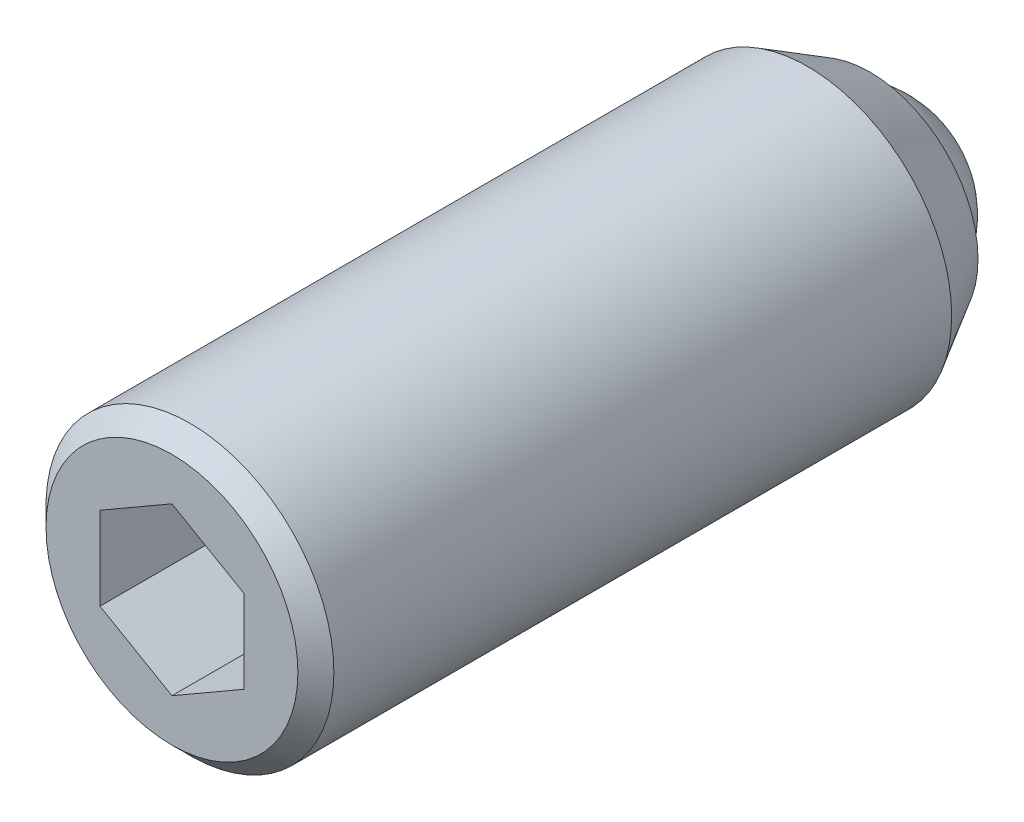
ISO-10303-21;
HEADER;
FILE_DESCRIPTION(('STEP AP214'),'2;1');
FILE_NAME('part.step','',(''),(''),'','','');
FILE_SCHEMA(('AUTOMOTIVE_DESIGN { 1 0 10303 214 1 1 1 1 }'));
ENDSEC;
DATA;
#1=APPLICATION_CONTEXT('core data for automotive mechanical design processes');
#2=APPLICATION_PROTOCOL_DEFINITION('international standard','automotive_design',2000,#1);
#3=PRODUCT_CONTEXT('',#1,'mechanical');
#4=PRODUCT('Part','Part','',(#3));
#5=PRODUCT_RELATED_PRODUCT_CATEGORY('part','',(#4));
#6=PRODUCT_DEFINITION_FORMATION('','',#4);
#7=PRODUCT_DEFINITION_CONTEXT('part definition',#1,'design');
#8=PRODUCT_DEFINITION('design','',#6,#7);
#9=PRODUCT_DEFINITION_SHAPE('','',#8);
#10=(LENGTH_UNIT() NAMED_UNIT(*) SI_UNIT(.MILLI.,.METRE.));
#11=(NAMED_UNIT(*) PLANE_ANGLE_UNIT() SI_UNIT($,.RADIAN.));
#12=(NAMED_UNIT(*) SI_UNIT($,.STERADIAN.) SOLID_ANGLE_UNIT());
#13=UNCERTAINTY_MEASURE_WITH_UNIT(LENGTH_MEASURE(1.E-05),#10,'distance_accuracy_value','');
#14=(GEOMETRIC_REPRESENTATION_CONTEXT(3) GLOBAL_UNCERTAINTY_ASSIGNED_CONTEXT((#13)) GLOBAL_UNIT_ASSIGNED_CONTEXT((#10,
#11,#12)) REPRESENTATION_CONTEXT('',''));
#15=CARTESIAN_POINT('',(0.,0.,0.));
#16=DIRECTION('',(0.,0.,1.));
#17=DIRECTION('',(1.,0.,0.));
#18=AXIS2_PLACEMENT_3D('',#15,#16,#17);
#19=CARTESIAN_POINT('',(2.,1.15470053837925,18.75));
#20=DIRECTION('',(0.5,0.86602540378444,0.));
#21=DIRECTION('',(0.86602540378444,-0.5,0.));
#22=AXIS2_PLACEMENT_3D('',#19,#20,#21);
#23=PLANE('',#22);
#24=DIRECTION('',(0.,0.,1.));
#25=VECTOR('',#24,1.);
#26=CARTESIAN_POINT('',(2.,1.15470053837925,18.75));
#27=LINE('',#26,#25);
#28=CARTESIAN_POINT('',(2.,1.15470053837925,17.25));
#29=VERTEX_POINT('',#28);
#30=CARTESIAN_POINT('',(2.,1.15470053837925,21.25));
#31=VERTEX_POINT('',#30);
#32=EDGE_CURVE('E68',#29,#31,#27,.T.);
#33=ORIENTED_EDGE('',*,*,#32,.T.);
#34=DIRECTION('',(-0.86602540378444,0.5,0.));
#35=VECTOR('',#34,1.);
#36=CARTESIAN_POINT('',(2.,1.15470053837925,21.25));
#37=LINE('',#36,#35);
#38=CARTESIAN_POINT('',(0.,2.3094010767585,21.25));
#39=VERTEX_POINT('',#38);
#40=EDGE_CURVE('E29',#31,#39,#37,.T.);
#41=ORIENTED_EDGE('',*,*,#40,.T.);
#42=DIRECTION('',(0.,0.,1.));
#43=VECTOR('',#42,1.);
#44=CARTESIAN_POINT('',(0.,2.3094010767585,18.75));
#45=LINE('',#44,#43);
#46=CARTESIAN_POINT('',(0.,2.3094010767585,17.25));
#47=VERTEX_POINT('',#46);
#48=EDGE_CURVE('E80',#47,#39,#45,.T.);
#49=ORIENTED_EDGE('',*,*,#48,.F.);
#50=DIRECTION('',(-0.86602540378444,0.5,0.));
#51=VECTOR('',#50,1.);
#52=CARTESIAN_POINT('',(2.,1.15470053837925,17.25));
#53=LINE('',#52,#51);
#54=EDGE_CURVE('E79',#29,#47,#53,.T.);
#55=ORIENTED_EDGE('',*,*,#54,.F.);
#56=EDGE_LOOP('',(#33,#41,#49,#55));
#57=FACE_BOUND('',#56,.T.);
#58=ADVANCED_FACE('F14',(#57),#23,.F.);
#59=CARTESIAN_POINT('',(2.,-1.15470053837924,18.75));
#60=DIRECTION('',(1.,0.,0.));
#61=DIRECTION('',(0.,0.,1.));
#62=AXIS2_PLACEMENT_3D('',#59,#60,#61);
#63=PLANE('',#62);
#64=DIRECTION('',(0.,0.,1.));
#65=VECTOR('',#64,1.);
#66=CARTESIAN_POINT('',(2.,-1.15470053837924,18.75));
#67=LINE('',#66,#65);
#68=CARTESIAN_POINT('',(2.,-1.15470053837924,17.25));
#69=VERTEX_POINT('',#68);
#70=CARTESIAN_POINT('',(2.,-1.15470053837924,21.25));
#71=VERTEX_POINT('',#70);
#72=EDGE_CURVE('E76',#69,#71,#67,.T.);
#73=ORIENTED_EDGE('',*,*,#72,.T.);
#74=DIRECTION('',(0.,1.,0.));
#75=VECTOR('',#74,1.);
#76=CARTESIAN_POINT('',(2.,-1.15470053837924,21.25));
#77=LINE('',#76,#75);
#78=EDGE_CURVE('E75',#71,#31,#77,.T.);
#79=ORIENTED_EDGE('',*,*,#78,.T.);
#80=ORIENTED_EDGE('',*,*,#32,.F.);
#81=DIRECTION('',(0.,1.,0.));
#82=VECTOR('',#81,1.);
#83=CARTESIAN_POINT('',(2.,-1.15470053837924,17.25));
#84=LINE('',#83,#82);
#85=EDGE_CURVE('E72',#69,#29,#84,.T.);
#86=ORIENTED_EDGE('',*,*,#85,.F.);
#87=EDGE_LOOP('',(#73,#79,#80,#86));
#88=FACE_BOUND('',#87,.T.);
#89=ADVANCED_FACE('F70',(#88),#63,.F.);
#90=CARTESIAN_POINT('',(2.,-1.15470053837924,18.75));
#91=DIRECTION('',(-0.5,0.866025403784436,0.));
#92=DIRECTION('',(0.866025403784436,0.5,0.));
#93=AXIS2_PLACEMENT_3D('',#90,#91,#92);
#94=PLANE('',#93);
#95=DIRECTION('',(0.,0.,1.));
#96=VECTOR('',#95,1.);
#97=CARTESIAN_POINT('',(0.,-2.30940107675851,18.75));
#98=LINE('',#97,#96);
#99=CARTESIAN_POINT('',(0.,-2.30940107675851,17.25));
#100=VERTEX_POINT('',#99);
#101=CARTESIAN_POINT('',(0.,-2.30940107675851,21.25));
#102=VERTEX_POINT('',#101);
#103=EDGE_CURVE('E122',#100,#102,#98,.T.);
#104=ORIENTED_EDGE('',*,*,#103,.T.);
#105=DIRECTION('',(-0.866025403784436,-0.5,0.));
#106=VECTOR('',#105,1.);
#107=CARTESIAN_POINT('',(2.,-1.15470053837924,21.25));
#108=LINE('',#107,#106);
#109=EDGE_CURVE('E113',#71,#102,#108,.T.);
#110=ORIENTED_EDGE('',*,*,#109,.F.);
#111=ORIENTED_EDGE('',*,*,#72,.F.);
#112=DIRECTION('',(0.866025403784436,0.5,0.));
#113=VECTOR('',#112,1.);
#114=CARTESIAN_POINT('',(0.,-2.30940107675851,17.25));
#115=LINE('',#114,#113);
#116=EDGE_CURVE('E89',#100,#69,#115,.T.);
#117=ORIENTED_EDGE('',*,*,#116,.F.);
#118=EDGE_LOOP('',(#104,#110,#111,#117));
#119=FACE_BOUND('',#118,.T.);
#120=ADVANCED_FACE('F147',(#119),#94,.T.);
#121=CARTESIAN_POINT('',(-2.,-1.15470053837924,18.75));
#122=DIRECTION('',(-0.5,-0.866025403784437,0.));
#123=DIRECTION('',(-0.866025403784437,0.5,0.));
#124=AXIS2_PLACEMENT_3D('',#121,#122,#123);
#125=PLANE('',#124);
#126=DIRECTION('',(0.,0.,1.));
#127=VECTOR('',#126,1.);
#128=CARTESIAN_POINT('',(-2.,-1.15470053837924,18.75));
#129=LINE('',#128,#127);
#130=CARTESIAN_POINT('',(-2.,-1.15470053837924,17.25));
#131=VERTEX_POINT('',#130);
#132=CARTESIAN_POINT('',(-2.,-1.15470053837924,21.25));
#133=VERTEX_POINT('',#132);
#134=EDGE_CURVE('E120',#131,#133,#129,.T.);
#135=ORIENTED_EDGE('',*,*,#134,.T.);
#136=DIRECTION('',(0.866025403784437,-0.5,0.));
#137=VECTOR('',#136,1.);
#138=CARTESIAN_POINT('',(-2.,-1.15470053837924,21.25));
#139=LINE('',#138,#137);
#140=EDGE_CURVE('E111',#133,#102,#139,.T.);
#141=ORIENTED_EDGE('',*,*,#140,.T.);
#142=ORIENTED_EDGE('',*,*,#103,.F.);
#143=DIRECTION('',(0.866025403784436,-0.5,0.));
#144=VECTOR('',#143,1.);
#145=CARTESIAN_POINT('',(-2.,-1.15470053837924,17.25));
#146=LINE('',#145,#144);
#147=EDGE_CURVE('E101',#131,#100,#146,.T.);
#148=ORIENTED_EDGE('',*,*,#147,.F.);
#149=EDGE_LOOP('',(#135,#141,#142,#148));
#150=FACE_BOUND('',#149,.T.);
#151=ADVANCED_FACE('F157',(#150),#125,.F.);
#152=CARTESIAN_POINT('',(-2.,-1.15470053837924,18.75));
#153=DIRECTION('',(1.,0.,0.));
#154=DIRECTION('',(0.,0.,1.));
#155=AXIS2_PLACEMENT_3D('',#152,#153,#154);
#156=PLANE('',#155);
#157=DIRECTION('',(0.,0.,1.));
#158=VECTOR('',#157,1.);
#159=CARTESIAN_POINT('',(-2.,1.15470053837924,18.75));
#160=LINE('',#159,#158);
#161=CARTESIAN_POINT('',(-2.,1.15470053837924,17.25));
#162=VERTEX_POINT('',#161);
#163=CARTESIAN_POINT('',(-2.,1.15470053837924,21.25));
#164=VERTEX_POINT('',#163);
#165=EDGE_CURVE('E37',#162,#164,#160,.T.);
#166=ORIENTED_EDGE('',*,*,#165,.T.);
#167=DIRECTION('',(0.,1.,0.));
#168=VECTOR('',#167,1.);
#169=CARTESIAN_POINT('',(-2.,-1.15470053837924,21.25));
#170=LINE('',#169,#168);
#171=EDGE_CURVE('E108',#133,#164,#170,.T.);
#172=ORIENTED_EDGE('',*,*,#171,.F.);
#173=ORIENTED_EDGE('',*,*,#134,.F.);
#174=DIRECTION('',(0.,-1.,0.));
#175=VECTOR('',#174,1.);
#176=CARTESIAN_POINT('',(-2.,1.15470053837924,17.25));
#177=LINE('',#176,#175);
#178=EDGE_CURVE('E98',#162,#131,#177,.T.);
#179=ORIENTED_EDGE('',*,*,#178,.F.);
#180=EDGE_LOOP('',(#166,#172,#173,#179));
#181=FACE_BOUND('',#180,.T.);
#182=ADVANCED_FACE('F153',(#181),#156,.T.);
#183=CARTESIAN_POINT('',(-2.,1.15470053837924,18.75));
#184=DIRECTION('',(0.5,-0.866025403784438,0.));
#185=DIRECTION('',(-0.866025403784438,-0.5,0.));
#186=AXIS2_PLACEMENT_3D('',#183,#184,#185);
#187=PLANE('',#186);
#188=ORIENTED_EDGE('',*,*,#165,.F.);
#189=DIRECTION('',(-0.866025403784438,-0.5,0.));
#190=VECTOR('',#189,1.);
#191=CARTESIAN_POINT('',(0.,2.3094010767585,17.25));
#192=LINE('',#191,#190);
#193=EDGE_CURVE('E84',#47,#162,#192,.T.);
#194=ORIENTED_EDGE('',*,*,#193,.F.);
#195=ORIENTED_EDGE('',*,*,#48,.T.);
#196=DIRECTION('',(0.866025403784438,0.5,0.));
#197=VECTOR('',#196,1.);
#198=CARTESIAN_POINT('',(-2.,1.15470053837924,21.25));
#199=LINE('',#198,#197);
#200=EDGE_CURVE('E105',#164,#39,#199,.T.);
#201=ORIENTED_EDGE('',*,*,#200,.F.);
#202=EDGE_LOOP('',(#188,#194,#195,#201));
#203=FACE_BOUND('',#202,.T.);
#204=ADVANCED_FACE('F150',(#203),#187,.T.);
#205=CARTESIAN_POINT('',(0.,0.,21.));
#206=DIRECTION('',(0.,0.,-1.));
#207=DIRECTION('',(1.,0.,0.));
#208=AXIS2_PLACEMENT_3D('',#205,#206,#207);
#209=CYLINDRICAL_SURFACE('',#208,4.);
#210=CARTESIAN_POINT('',(0.,0.,20.75));
#211=DIRECTION('',(0.,0.,-1.));
#212=DIRECTION('',(1.,0.,0.));
#213=AXIS2_PLACEMENT_3D('',#210,#211,#212);
#214=CIRCLE('',#213,4.);
#215=CARTESIAN_POINT('',(4.,0.,20.75));
#216=VERTEX_POINT('',#215);
#217=EDGE_CURVE('E9',#216,#216,#214,.T.);
#218=ORIENTED_EDGE('',*,*,#217,.T.);
#219=EDGE_LOOP('',(#218));
#220=FACE_BOUND('',#219,.T.);
#221=CARTESIAN_POINT('',(0.,0.,3.58205080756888));
#222=DIRECTION('',(0.,0.,-1.));
#223=DIRECTION('',(-1.,0.,0.));
#224=AXIS2_PLACEMENT_3D('',#221,#222,#223);
#225=CIRCLE('',#224,4.);
#226=CARTESIAN_POINT('',(-4.,0.,3.58205080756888));
#227=VERTEX_POINT('',#226);
#228=EDGE_CURVE('E244',#227,#227,#225,.T.);
#229=ORIENTED_EDGE('',*,*,#228,.F.);
#230=EDGE_LOOP('',(#229));
#231=FACE_BOUND('',#230,.T.);
#232=ADVANCED_FACE('F16',(#220,#231),#209,.T.);
#233=CARTESIAN_POINT('',(0.,0.,20.75));
#234=DIRECTION('',(0.,0.,-1.));
#235=DIRECTION('',(1.,0.,0.));
#236=AXIS2_PLACEMENT_3D('',#233,#234,#235);
#237=CONICAL_SURFACE('',#236,4.,0.785398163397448);
#238=CARTESIAN_POINT('',(0.,0.,21.25));
#239=DIRECTION('',(0.,0.,-1.));
#240=DIRECTION('',(1.,0.,0.));
#241=AXIS2_PLACEMENT_3D('',#238,#239,#240);
#242=CIRCLE('',#241,3.5);
#243=CARTESIAN_POINT('',(3.5,0.,21.25));
#244=VERTEX_POINT('',#243);
#245=EDGE_CURVE('E22',#244,#244,#242,.T.);
#246=ORIENTED_EDGE('',*,*,#245,.T.);
#247=EDGE_LOOP('',(#246));
#248=FACE_BOUND('',#247,.T.);
#249=ORIENTED_EDGE('',*,*,#217,.F.);
#250=EDGE_LOOP('',(#249));
#251=FACE_BOUND('',#250,.T.);
#252=ADVANCED_FACE('F127',(#248,#251),#237,.T.);
#253=CARTESIAN_POINT('',(0.,0.,21.25));
#254=DIRECTION('',(0.,0.,-1.));
#255=DIRECTION('',(1.,0.,0.));
#256=AXIS2_PLACEMENT_3D('',#253,#254,#255);
#257=PLANE('',#256);
#258=ORIENTED_EDGE('',*,*,#200,.T.);
#259=ORIENTED_EDGE('',*,*,#40,.F.);
#260=ORIENTED_EDGE('',*,*,#78,.F.);
#261=ORIENTED_EDGE('',*,*,#109,.T.);
#262=ORIENTED_EDGE('',*,*,#140,.F.);
#263=ORIENTED_EDGE('',*,*,#171,.T.);
#264=EDGE_LOOP('',(#258,#259,#260,#261,#262,#263));
#265=FACE_BOUND('',#264,.T.);
#266=ORIENTED_EDGE('',*,*,#245,.F.);
#267=EDGE_LOOP('',(#266));
#268=FACE_BOUND('',#267,.T.);
#269=ADVANCED_FACE('F130',(#265,#268),#257,.F.);
#270=CARTESIAN_POINT('',(2.,1.15470053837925,17.25));
#271=DIRECTION('',(0.,0.,1.));
#272=DIRECTION('',(1.,0.,0.));
#273=AXIS2_PLACEMENT_3D('',#270,#271,#272);
#274=PLANE('',#273);
#275=ORIENTED_EDGE('',*,*,#85,.T.);
#276=ORIENTED_EDGE('',*,*,#54,.T.);
#277=ORIENTED_EDGE('',*,*,#193,.T.);
#278=ORIENTED_EDGE('',*,*,#178,.T.);
#279=ORIENTED_EDGE('',*,*,#147,.T.);
#280=ORIENTED_EDGE('',*,*,#116,.T.);
#281=EDGE_LOOP('',(#275,#276,#277,#278,#279,#280));
#282=FACE_BOUND('',#281,.T.);
#283=ADVANCED_FACE('F86',(#282),#274,.T.);
#284=CARTESIAN_POINT('',(0.,0.,2.75));
#285=DIRECTION('',(0.,0.,-1.));
#286=DIRECTION('',(-1.,0.,0.));
#287=AXIS2_PLACEMENT_3D('',#284,#285,#286);
#288=SPHERICAL_SURFACE('',#287,2.75);
#289=CARTESIAN_POINT('',(0.,0.,1.85));
#290=DIRECTION('',(0.,0.,-1.));
#291=DIRECTION('',(-1.,0.,0.));
#292=AXIS2_PLACEMENT_3D('',#289,#290,#291);
#293=CIRCLE('',#292,2.59855729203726);
#294=CARTESIAN_POINT('',(-2.59855729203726,0.,1.85));
#295=VERTEX_POINT('',#294);
#296=EDGE_CURVE('E90',#295,#295,#293,.T.);
#297=ORIENTED_EDGE('',*,*,#296,.T.);
#298=EDGE_LOOP('',(#297));
#299=FACE_BOUND('',#298,.T.);
#300=ADVANCED_FACE('F139',(#299),#288,.T.);
#301=CARTESIAN_POINT('',(-2.59855729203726,0.,1.85));
#302=DIRECTION('',(0.,0.,-1.));
#303=DIRECTION('',(-1.,0.,0.));
#304=AXIS2_PLACEMENT_3D('',#301,#302,#303);
#305=PLANE('',#304);
#306=CARTESIAN_POINT('',(0.,0.,1.85));
#307=DIRECTION('',(0.,0.,-1.));
#308=DIRECTION('',(-1.,0.,0.));
#309=AXIS2_PLACEMENT_3D('',#306,#307,#308);
#310=CIRCLE('',#309,3.);
#311=CARTESIAN_POINT('',(-3.,0.,1.85));
#312=VERTEX_POINT('',#311);
#313=EDGE_CURVE('E93',#312,#312,#310,.T.);
#314=ORIENTED_EDGE('',*,*,#313,.T.);
#315=EDGE_LOOP('',(#314));
#316=FACE_BOUND('',#315,.T.);
#317=ORIENTED_EDGE('',*,*,#296,.F.);
#318=EDGE_LOOP('',(#317));
#319=FACE_BOUND('',#318,.T.);
#320=ADVANCED_FACE('F216',(#316,#319),#305,.T.);
#321=CARTESIAN_POINT('',(0.,0.,1.85));
#322=DIRECTION('',(0.,0.,1.));
#323=DIRECTION('',(1.,0.,0.));
#324=AXIS2_PLACEMENT_3D('',#321,#322,#323);
#325=CONICAL_SURFACE('',#324,3.,0.523598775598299);
#326=ORIENTED_EDGE('',*,*,#228,.T.);
#327=EDGE_LOOP('',(#326));
#328=FACE_BOUND('',#327,.T.);
#329=ORIENTED_EDGE('',*,*,#313,.F.);
#330=EDGE_LOOP('',(#329));
#331=FACE_BOUND('',#330,.T.);
#332=ADVANCED_FACE('F225',(#328,#331),#325,.T.);
#333=CLOSED_SHELL('',(#58,#89,#120,#151,#182,#204,#232,#252,#269,#283,#300,#320,#332));
#334=MANIFOLD_SOLID_BREP('B1',#333);
#335=ADVANCED_BREP_SHAPE_REPRESENTATION('',(#18,#334),#14);
#336=SHAPE_DEFINITION_REPRESENTATION(#9,#335);
ENDSEC;
END-ISO-10303-21;
